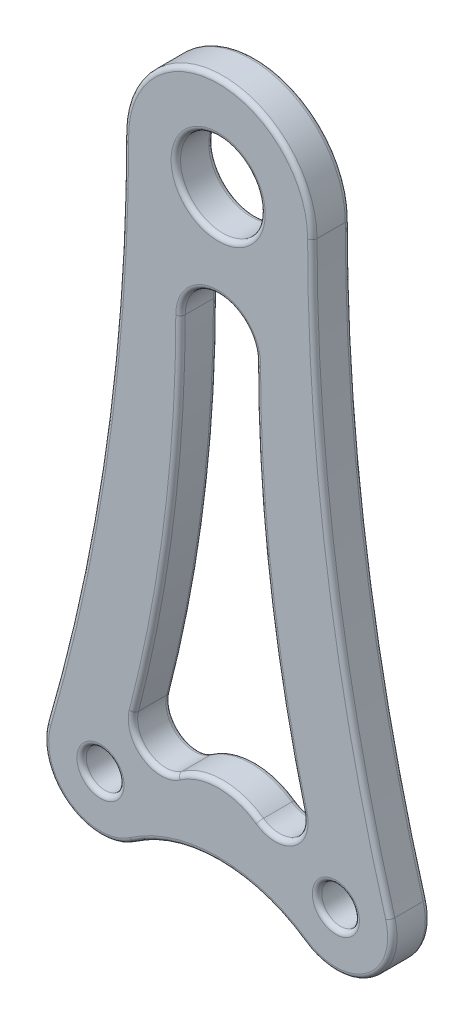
from build123d import *

# Parameters (mm, degrees)
SKETCH_1_R      = 4.5
SKETCH_1_R_2    = 2
EXTRUDE_1_DEPTH = 2
FILLET_1_R      = 0.5


with BuildPart() as part:
    # Sketch 1 → Extrude 1 (new, symmetric)
    with BuildSketch(Plane.XY):
        with BuildLine():
            ThreePointArc((10, 0), (0, 10), (-10, 0))
            ThreePointArc((-10, 0), (-12.076239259, -29.457949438), (-18.263904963, -58.333446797))
            ThreePointArc((-18.263904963, -58.333446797), (-16.005623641, -64.869353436), (-9.090909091, -64.93741827))
            ThreePointArc((-9.090909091, -64.93741827), (0, -62.10386699), (9.090909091, -64.93741827))
            ThreePointArc((9.090909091, -64.93741827), (16.005623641, -64.869353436), (18.263904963, -58.333446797))
            ThreePointArc((18.263904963, -58.333446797), (12.076239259, -29.457949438), (10, 0))
        make_face()
        Circle(SKETCH_1_R, mode=Mode.SUBTRACT)
        with Locations((-12.5, -60)):
            Circle(SKETCH_1_R_2, mode=Mode.SUBTRACT)
        with Locations(Location((12.5, -60, 0), (0, 0, 180))):
            Circle(SKETCH_1_R_2, mode=Mode.SUBTRACT)
        with BuildLine():
            ThreePointArc((4, -14), (0, -10), (-4, -14))
            ThreePointArc((-4, -14), (-5.243585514, -33.631388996), (-8.954460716, -52.948928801))
            ThreePointArc((-8.954460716, -52.948928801), (-7.756021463, -56.167689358), (-4.321428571, -56.151946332))
            ThreePointArc((-4.321428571, -56.151946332), (0, -54.781812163), (4.321428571, -56.151946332))
            ThreePointArc((4.321428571, -56.151946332), (7.756021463, -56.167689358), (8.954460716, -52.948928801))
            ThreePointArc((8.954460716, -52.948928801), (5.243585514, -33.631388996), (4, -14))
        make_face(mode=Mode.SUBTRACT)
    extrude(amount=EXTRUDE_1_DEPTH, both=True)

    # Fillet 1
    fillet_1_edges = [part.edges().sort_by_distance(p)[0] for p in [
        (12.076239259, -29.457949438, 2),
        (0, 10, 2),
        (-12.076239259, -29.457949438, 2),
        (-4.5, 0, -2),
        (-4.5, 0, 2),
        (-16.005623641, -64.869353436, 2),
        (0, -54.781812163, -2),
        (7.756021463, -56.167689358, -2),
        (5.243585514, -33.631388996, -2),
        (0, -10, -2),
        (-5.243585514, -33.631388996, -2),
        (-7.756021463, -56.167689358, -2),
        (0, -54.781812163, 2),
        (7.756021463, -56.167689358, 2),
        (5.243585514, -33.631388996, 2),
        (0, -10, 2),
        (-5.243585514, -33.631388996, 2),
        (-7.756021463, -56.167689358, 2),
        (-14.5, -60, -2),
        (-14.5, -60, 2),
        (0, -62.10386699, 2),
        (14.5, -60, -2),
        (14.5, -60, 2),
        (-16.005623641, -64.869353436, -2),
        (-12.076239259, -29.457949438, -2),
        (0, 10, -2),
        (16.005623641, -64.869353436, 2),
        (12.076239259, -29.457949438, -2),
        (16.005623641, -64.869353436, -2),
        (0, -62.10386699, -2),
    ]]
    fillet(fillet_1_edges, radius=FILLET_1_R)


solid = part.part
